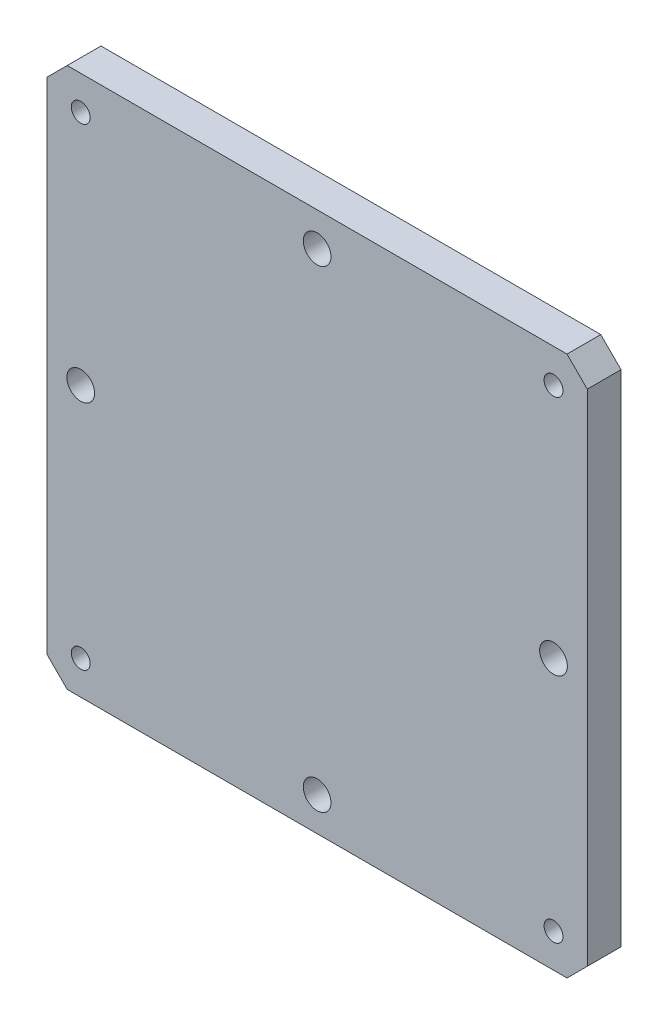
from build123d import *

# Parameters (mm, degrees)
SKETCH_1_W          = 400
SKETCH_1_H          = 400
EXTRUDE_1_DEPTH     = 25
HOLE_WIZARD_M161_D  = 14
CHAMFER_1_SIZE      = 2
SKETCH_4_R          = 10.25
CUT_EXTRUDE_1_DEPTH = 567.237582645
CHAMFER_2_SIZE      = 15


with BuildPart() as part:
    # Sketch 1 → Extrude 1 (new body)
    with BuildSketch(Plane.XY):
        with Locations((200, 200)):
            Rectangle(SKETCH_1_W, SKETCH_1_H)
    extrude(amount=EXTRUDE_1_DEPTH)

    # Hole Wizard M161 (through all)
    with Locations(Plane(origin=(0, 0, 0), x_dir=(-1, 0, 0), z_dir=(0, 0, -1))):
        with Locations((-375, 375), (-25, 375), (-25, 25), (-375, 25)):
            Hole(HOLE_WIZARD_M161_D / 2)

    # Chamfer 1
    chamfer_1_edges = [part.edges().sort_by_distance(p)[0] for p in [
        (368, 25, 0),
        (18, 25, 0),
        (18, 375, 0),
        (368, 375, 0),
    ]]
    chamfer(chamfer_1_edges, length=CHAMFER_1_SIZE)

    # Sketch 4 → Cut-Extrude 1 (cut, through all)
    with BuildSketch(Plane(origin=(0, 0, 0), x_dir=(-1, 0, 0), z_dir=(0, 0, -1))):
        with Locations((-200, 375)):
            Circle(SKETCH_4_R)
        with Locations((-25, 200)):
            Circle(SKETCH_4_R)
        with Locations((-200, 25)):
            Circle(SKETCH_4_R)
        with Locations((-375, 200)):
            Circle(SKETCH_4_R)
    extrude(amount=-CUT_EXTRUDE_1_DEPTH, mode=Mode.SUBTRACT)

    # Chamfer 2
    chamfer_2_edges = [part.edges().sort_by_distance(p)[0] for p in [
        (0, 400, 12.5),
        (400, 400, 12.5),
        (400, 0, 12.5),
        (0, 0, 12.5),
    ]]
    chamfer(chamfer_2_edges, length=CHAMFER_2_SIZE)


solid = part.part
